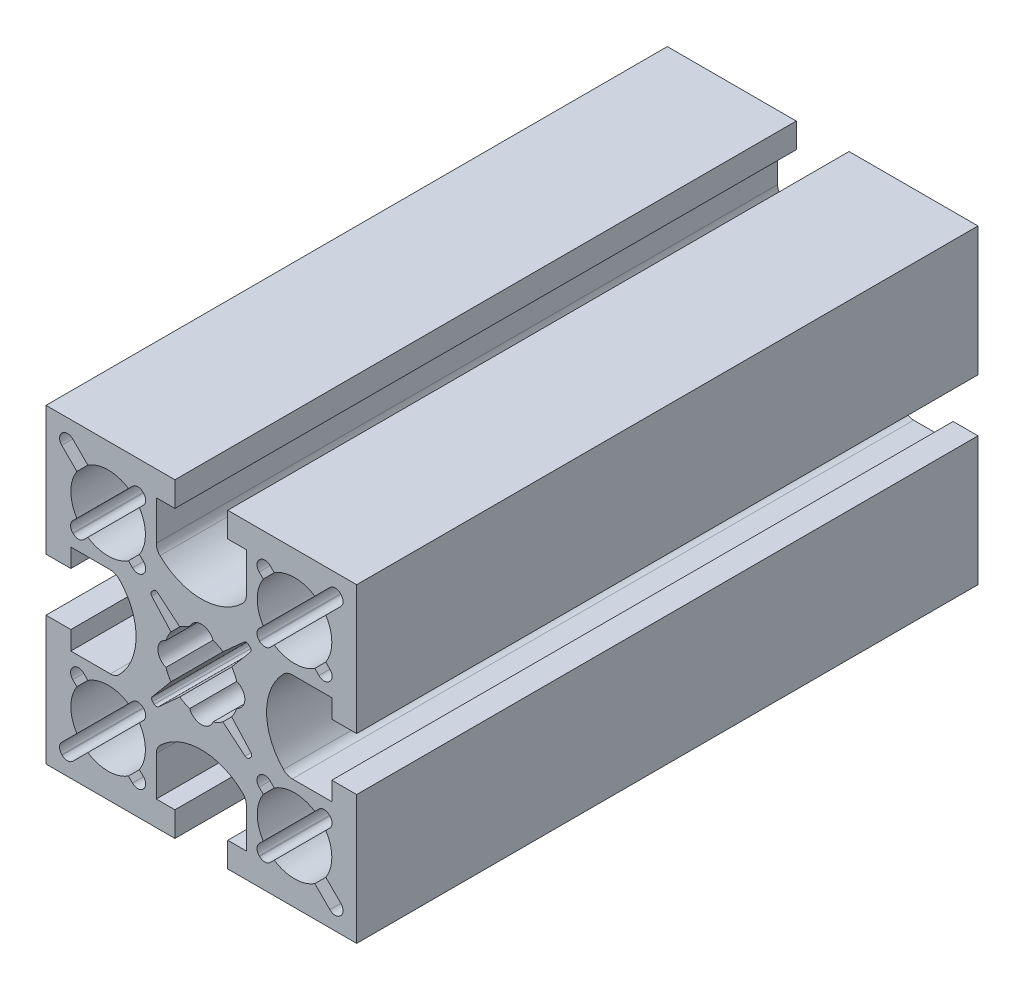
from build123d import *

# Parameters (mm, degrees)
SKETCH_1_W                       = 50
SKETCH_1_H                       = 50
EXTRUDE_1_DEPTH                  = 50
SKETCH_10_R                      = 6
CUT_EXTRUDE_8_DEPTH              = 107.066017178
CUT_EXTRUDE_9_DEPTH              = 107.066017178
CUT_EXTRUDE_10_DEPTH             = 107.066017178
PATTERN_CIRCULAR_1_COUNT         = 4
SKETCH_14_R                      = 6
CUT_EXTRUDE_11_DEPTH             = 107.066017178
CUT_EXTRUDE_12_DEPTH             = 107.066017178
PATTERN_CIRCULAR_2_COUNT         = 4
CUT_EXTRUDE_13_DEPTH             = 107.066017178
FILLET_2_R                       = 2
PATTERN_CIRCULAR_3_COUNT         = 4
FILLET_2_OF_PATTERN_CIRCULAR_3_R = 2


with BuildPart() as part:
    # Sketch 1 → Extrude 1 (new, symmetric)
    with BuildSketch(Plane.XY):
        Rectangle(SKETCH_1_W, SKETCH_1_H)
    extrude(amount=EXTRUDE_1_DEPTH, both=True)

    # Sketch 10 → Cut-Extrude 8 (cut, through all)
    with BuildSketch(Plane.XY.offset(50)):
        Circle(SKETCH_10_R)
    extrude(amount=-CUT_EXTRUDE_8_DEPTH, mode=Mode.SUBTRACT)

    # Sketch 11 → Cut-Extrude 9 (cut, through all)
    with BuildSketch(Plane.XY.offset(50)):
        with BuildLine():
            Line((7.875977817, 7.034258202), (4.890406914, 3.476193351))
            ThreePointArc((4.890406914, 3.476193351), (6, 0), (4.890406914, -3.476193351))
            Line((4.890406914, -3.476193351), (7.977246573, -6.904476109))
            ThreePointArc((7.977246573, -6.904476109), (8.10562632, -7.24595795), (7.967849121, -7.58375767))
            ThreePointArc((7.967849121, -7.58375767), (7.838013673, -7.717871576), (7.70592115, -7.849763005))
            ThreePointArc((7.70592115, -7.849763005), (7.375152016, -7.992575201), (7.034258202, -7.875977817))
            Line((7.034258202, -7.875977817), (3.476193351, -4.890406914))
            ThreePointArc((3.476193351, -4.890406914), (0, -6), (-3.476193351, -4.890406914))
            Line((-3.476193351, -4.890406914), (-6.904476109, -7.977246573))
            ThreePointArc((-6.904476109, -7.977246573), (-7.24595795, -8.10562632), (-7.58375767, -7.967849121))
            ThreePointArc((-7.58375767, -7.967849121), (-7.717871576, -7.838013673), (-7.849763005, -7.70592115))
            ThreePointArc((-7.849763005, -7.70592115), (-7.992575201, -7.375152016), (-7.875977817, -7.034258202))
            Line((-7.875977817, -7.034258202), (-4.890406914, -3.476193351))
            ThreePointArc((-4.890406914, -3.476193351), (-6, 0), (-4.890406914, 3.476193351))
            Line((-4.890406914, 3.476193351), (-7.977246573, 6.904476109))
            ThreePointArc((-7.977246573, 6.904476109), (-8.10562632, 7.24595795), (-7.967849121, 7.58375767))
            ThreePointArc((-7.967849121, 7.58375767), (-7.838013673, 7.717871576), (-7.70592115, 7.849763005))
            ThreePointArc((-7.70592115, 7.849763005), (-7.375152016, 7.992575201), (-7.034258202, 7.875977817))
            Line((-7.034258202, 7.875977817), (-3.476193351, 4.890406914))
            ThreePointArc((-3.476193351, 4.890406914), (0, 6), (3.476193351, 4.890406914))
            Line((3.476193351, 4.890406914), (6.904476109, 7.977246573))
            ThreePointArc((6.904476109, 7.977246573), (7.24595795, 8.10562632), (7.58375767, 7.967849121))
            ThreePointArc((7.58375767, 7.967849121), (7.717871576, 7.838013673), (7.849763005, 7.70592115))
            ThreePointArc((7.849763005, 7.70592115), (7.992575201, 7.375152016), (7.875977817, 7.034258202))
        make_face()
    extrude(amount=-CUT_EXTRUDE_9_DEPTH, mode=Mode.SUBTRACT)

    # Sketch 13 → Cut-Extrude 10 (cut, through all)
    with BuildSketch(Plane.XY.offset(50)):
        with BuildLine():
            ThreePointArc((-1.8734994, 5.7), (0, 7), (1.8734994, 5.7))
            ThreePointArc((1.8734994, 5.7), (0, 6), (-1.8734994, 5.7))
        make_face()
    cut_extrude_10 = extrude(amount=-CUT_EXTRUDE_10_DEPTH, mode=Mode.SUBTRACT)

    # Pattern Circular 1: Cut-Extrude 10 ×4 about axis
    pattern_circular_1_axis = Axis((0, 0, 0), (0, 0, 1))
    for i in range(1, PATTERN_CIRCULAR_1_COUNT):
        add(cut_extrude_10.rotate(pattern_circular_1_axis, i * 360 / PATTERN_CIRCULAR_1_COUNT), mode=Mode.SUBTRACT)

    # Sketch 14 → Cut-Extrude 11 (cut, through all)
    with BuildSketch(Plane.XY.offset(50)):
        with Locations((-15, 15)):
            Circle(SKETCH_14_R)
    cut_extrude_11 = extrude(amount=-CUT_EXTRUDE_11_DEPTH, mode=Mode.SUBTRACT)

    # Sketch 15 → Cut-Extrude 12 (cut, through all)
    with BuildSketch(Plane.XY.offset(50)):
        with BuildLine():
            Line((-9.966568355, 18.265664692), (-9.307920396, 18.924312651))
            ThreePointArc((-9.307920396, 18.924312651), (-8.956456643, 19.768428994), (-9.301704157, 20.61510681))
            ThreePointArc((-9.301704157, 20.61510681), (-9.343145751, 20.656854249), (-9.38489319, 20.698295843))
            ThreePointArc((-9.38489319, 20.698295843), (-10.231571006, 21.043543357), (-11.075687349, 20.692079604))
            Line((-11.075687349, 20.692079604), (-11.734335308, 20.033431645))
            ThreePointArc((-11.734335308, 20.033431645), (-15, 21), (-18.265664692, 20.033431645))
            Line((-18.265664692, 20.033431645), (-20.692114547, 22.4598815))
            ThreePointArc((-20.692114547, 22.4598815), (-21.537416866, 22.811349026), (-22.384596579, 22.464431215))
            ThreePointArc((-22.384596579, 22.464431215), (-22.424621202, 22.424621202), (-22.464431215, 22.384596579))
            ThreePointArc((-22.464431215, 22.384596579), (-22.811349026, 21.537416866), (-22.4598815, 20.692114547))
            Line((-22.4598815, 20.692114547), (-20.033431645, 18.265664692))
            ThreePointArc((-20.033431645, 18.265664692), (-21, 15), (-20.033431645, 11.734335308))
            Line((-20.033431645, 11.734335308), (-20.692079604, 11.075687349))
            ThreePointArc((-20.692079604, 11.075687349), (-21.043543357, 10.231571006), (-20.698295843, 9.38489319))
            ThreePointArc((-20.698295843, 9.38489319), (-20.656854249, 9.343145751), (-20.61510681, 9.301704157))
            ThreePointArc((-20.61510681, 9.301704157), (-19.768428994, 8.956456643), (-18.924312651, 9.307920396))
            Line((-18.924312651, 9.307920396), (-18.265664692, 9.966568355))
            ThreePointArc((-18.265664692, 9.966568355), (-15, 9), (-11.734335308, 9.966568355))
            Line((-11.734335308, 9.966568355), (-11.075687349, 9.307920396))
            ThreePointArc((-11.075687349, 9.307920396), (-10.231571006, 8.956456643), (-9.38489319, 9.301704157))
            ThreePointArc((-9.38489319, 9.301704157), (-9.343145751, 9.343145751), (-9.301704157, 9.38489319))
            ThreePointArc((-9.301704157, 9.38489319), (-8.956456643, 10.231571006), (-9.307920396, 11.075687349))
            Line((-9.307920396, 11.075687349), (-9.966568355, 11.734335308))
            ThreePointArc((-9.966568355, 11.734335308), (-9, 15), (-9.966568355, 18.265664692))
        make_face()
    cut_extrude_12 = extrude(amount=-CUT_EXTRUDE_12_DEPTH, mode=Mode.SUBTRACT)

    # Pattern Circular 2: Cut-Extrude 11, Cut-Extrude 12 ×4 about axis
    pattern_circular_2_axis = Axis((0, 0, 0), (0, 0, 1))
    add([cut_extrude_11.rotate(pattern_circular_2_axis, i * 360 / PATTERN_CIRCULAR_2_COUNT) for i in range(1, PATTERN_CIRCULAR_2_COUNT)], mode=Mode.SUBTRACT)
    add([cut_extrude_12.rotate(pattern_circular_2_axis, i * 360 / PATTERN_CIRCULAR_2_COUNT) for i in range(1, PATTERN_CIRCULAR_2_COUNT)], mode=Mode.SUBTRACT)

    # Sketch 16 → Cut-Extrude 13 (cut, through all)
    with BuildSketch(Plane.XY.offset(50)):
        with BuildLine():
            ThreePointArc((-7.25, 13.860985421), (-3.995582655, 11.381106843), (0, 10.5))
            Line((0, 10.5), (0, 25))
            Line((0, 25), (-4.25, 25))
            Line((-4.25, 25), (-4.25, 21))
            Line((-4.25, 21), (-7.25, 21))
            Line((-7.25, 21), (-7.25, 13.860985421))
        make_face()
        with BuildLine():
            Line((0, 25), (0, 10.5))
            ThreePointArc((0, 10.5), (3.995582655, 11.381106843), (7.25, 13.860985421))
            Line((7.25, 13.860985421), (7.25, 21))
            Line((7.25, 21), (4.25, 21))
            Line((4.25, 21), (4.25, 25))
            Line((4.25, 25), (0, 25))
        make_face()
    cut_extrude_13 = extrude(amount=-CUT_EXTRUDE_13_DEPTH, mode=Mode.SUBTRACT)

    # Fillet 2
    fillet_2_edges = [part.edges().sort_by_distance(p)[0] for p in [
        (7.25, 13.860985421, 0),
        (-7.25, 13.860985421, 0),
    ]]
    fillet(fillet_2_edges, radius=FILLET_2_R)

    # Pattern Circular 3: Cut-Extrude 13 ×4 about axis
    pattern_circular_3_axis = Axis((0, 0, 0), (0, 0, 1))
    for i in range(1, PATTERN_CIRCULAR_3_COUNT):
        add(cut_extrude_13.rotate(pattern_circular_3_axis, i * 360 / PATTERN_CIRCULAR_3_COUNT), mode=Mode.SUBTRACT)

    # Fillet 2 of Pattern Circular 3
    fillet_2_of_pattern_circular_3_edges = [part.edges().sort_by_distance(p)[0] for p in [
        (-13.860985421, 7.25, 0),
        (-13.860985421, -7.25, 0),
        (-7.25, -13.860985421, 0),
        (7.25, -13.860985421, 0),
        (13.860985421, -7.25, 0),
        (13.860985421, 7.25, 0),
    ]]
    fillet(fillet_2_of_pattern_circular_3_edges, radius=FILLET_2_OF_PATTERN_CIRCULAR_3_R)


solid = part.part
